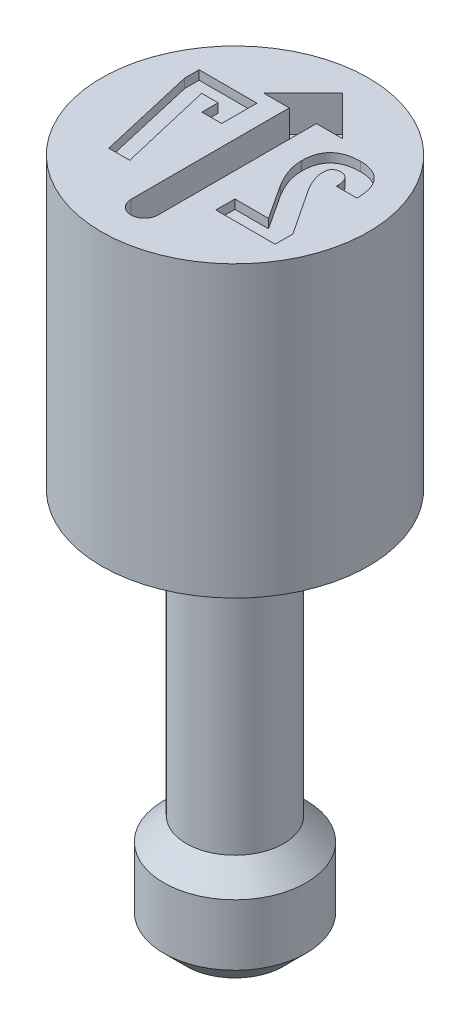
from build123d import *

# Parameters (mm, degrees)
CUT_EXTRUDE1_DEPTH = 0.4064
CUT_EXTRUDE2_DEPTH = 0.1016


with BuildPart() as part:
    # Sketch1 → Revolve1 (revolve)
    with BuildSketch(Plane.XY, mode=Mode.PRIVATE) as revolve1_sk:
        Polygon((0, 7.62), (1.4986, 7.62), (1.4986, 4.3688), (0.5461, 4.3688), (0.5461, 1.1938), (0.8, 0.9399), (0.8, 0.254), (0.546, 0), (0, 0), align=None)
    revolve(revolve1_sk.sketch.rotate(Axis((0, 0, 0), (0, 1, 0)), 90), axis=Axis((0, 0, 0), (0, 1, 0)))

    # Sketch2 → Cut-Extrude1 (cut)
    with BuildSketch(Plane(origin=(0, 7.62, 0), x_dir=(1, 0, 0), z_dir=(0, 1, 0))):
        with BuildLine():
            Line((0.1524, -1.016), (0.1524, 0.762))
            Line((0.1524, 0.762), (0.4445, 0.762))
            Line((0.4445, 0.762), (0, 1.2065))
            Line((0, 1.2065), (-0.4445, 0.762))
            Line((-0.4445, 0.762), (-0.1524, 0.762))
            Line((-0.1524, 0.762), (-0.1524, -1.016))
            ThreePointArc((-0.1524, -1.016), (0, -1.1684), (0.1524, -1.016))
        make_face()
    extrude(amount=-CUT_EXTRUDE1_DEPTH, mode=Mode.SUBTRACT)

    # Sketch3 → Cut-Extrude2 (cut)
    with BuildSketch(Plane(origin=(0, 7.62, 0), x_dir=(1, 0, 0), z_dir=(0, 1, 0))):
        with BuildLine():
            Line((1.093859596, -0.643446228), (1.093859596, -0.443462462))
            Line((1.093859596, -0.443462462), (0.749557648, 0.076340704))
            add(Edge.make_bspline(
                [(0.749557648, 0.076340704), (0.74265923, 0.087960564), (0.729227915, 0.11058459), (0.711563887, 0.144498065), (0.696358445, 0.177087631), (0.68433426, 0.208493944), (0.674730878, 0.238343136), (0.667660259, 0.266456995), (0.663232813, 0.292848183), (0.662704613, 0.309897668), (0.662451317, 0.318073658)],
                knots=[0, 0, 0, 0, 1.248122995, 2.430112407, 3.530856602, 4.568368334, 5.534599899, 6.425730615, 7.245067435, 8, 8, 8, 8], degree=3))
            Line((0.662451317, 0.318073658), (0.662451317, 0.327866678))
            add(Edge.make_bspline(
                [(0.662451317, 0.327866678), (0.662715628, 0.335707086), (0.663214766, 0.350513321), (0.667766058, 0.371312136), (0.675827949, 0.389014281), (0.687164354, 0.403661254), (0.701756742, 0.414940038), (0.719347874, 0.42305122), (0.739934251, 0.427929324), (0.754683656, 0.428389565), (0.7624432, 0.428631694)],
                knots=[0, 0, 0, 0, 1.157982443, 2.186794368, 3.124176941, 4.010641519, 4.897106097, 5.822980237, 6.854687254, 8, 8, 8, 8], degree=3))
            add(Edge.make_bspline(
                [(0.7624432, 0.428631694), (0.770497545, 0.42834535), (0.785892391, 0.427798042), (0.80742957, 0.420548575), (0.826583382, 0.409811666), (0.842197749, 0.393653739), (0.855078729, 0.373641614), (0.864325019, 0.349206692), (0.87114107, 0.320807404), (0.872861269, 0.30033481), (0.873774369, 0.289467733)],
                knots=[0, 0, 0, 0, 0.962338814, 1.839386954, 2.698744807, 3.573548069, 4.505816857, 5.537709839, 6.692989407, 8, 8, 8, 8], degree=3))
            Line((0.873774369, 0.289467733), (0.873774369, 0.264727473))
            Line((0.873774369, 0.264727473), (1.105198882, 0.264727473))
            Line((1.105198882, 0.264727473), (1.105198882, 0.288436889))
            add(Edge.make_bspline(
                [(1.105198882, 0.288436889), (1.104456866, 0.302456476), (1.103013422, 0.329728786), (1.097541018, 0.369271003), (1.089600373, 0.406340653), (1.079123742, 0.440756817), (1.066215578, 0.47270785), (1.05039138, 0.501791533), (1.032372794, 0.528713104), (1.011304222, 0.552640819), (0.988205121, 0.574172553), (0.962595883, 0.592480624), (0.935223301, 0.608494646), (0.90529631, 0.620898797), (0.873550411, 0.631176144), (0.839541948, 0.637835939), (0.803550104, 0.64252227), (0.778781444, 0.642869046), (0.766051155, 0.643047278)],
                knots=[0, 0, 0, 0, 1.213500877, 2.360623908, 3.447485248, 4.488371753, 5.467727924, 6.421569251, 7.346603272, 8.262676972, 9.172071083, 10.070969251, 10.979392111, 11.907908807, 12.866366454, 13.85987356, 14.900044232, 16, 16, 16, 16], degree=3))
            add(Edge.make_bspline(
                [(0.766051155, 0.643047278), (0.752727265, 0.642812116), (0.726879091, 0.642355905), (0.689380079, 0.63849567), (0.654362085, 0.631928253), (0.621577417, 0.623536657), (0.591515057, 0.611633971), (0.563617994, 0.597929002), (0.538586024, 0.580893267), (0.515640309, 0.561854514), (0.49551794, 0.540011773), (0.477823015, 0.515969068), (0.463149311, 0.48939213), (0.450880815, 0.46059832), (0.441757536, 0.429243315), (0.435122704, 0.39561202), (0.430857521, 0.359588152), (0.430459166, 0.334751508), (0.430253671, 0.321939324)],
                knots=[0, 0, 0, 0, 1.204109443, 2.335956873, 3.401973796, 4.42277956, 5.388848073, 6.319444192, 7.226053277, 8.118791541, 9.008824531, 9.903350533, 10.810591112, 11.746516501, 12.726709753, 13.756072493, 14.842451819, 16, 16, 16, 16], degree=3))
            Line((0.430253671, 0.321939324), (0.430253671, 0.312919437))
            add(Edge.make_bspline(
                [(0.430253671, 0.312919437), (0.430591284, 0.299584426), (0.431278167, 0.272454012), (0.437374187, 0.231087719), (0.446839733, 0.188424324), (0.460417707, 0.14456095), (0.477496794, 0.099896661), (0.497658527, 0.054323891), (0.521280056, 0.008259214), (0.539350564, -0.02194498), (0.548543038, -0.037309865)],
                knots=[0, 0, 0, 0, 0.854998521, 1.739515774, 2.676706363, 3.656336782, 4.681823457, 5.742648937, 6.851684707, 8, 8, 8, 8], degree=3))
            Line((0.548543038, -0.037309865), (0.805223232, -0.429030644))
            Line((0.805223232, -0.429030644), (0.42767656, -0.429030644))
            Line((0.42767656, -0.429030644), (0.42767656, -0.643446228))
            Line((0.42767656, -0.643446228), (1.093859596, -0.643446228))
        make_face()
        Polygon((-1.03004016, 0.626553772), (-1.03004016, 0.465226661), (-0.77439081, -0.643446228), (-0.53884292, -0.643446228), (-0.786503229, 0.412138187), (-0.602239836, 0.412138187), (-0.602239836, 0.230709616), (-0.380350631, 0.230709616), (-0.380350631, 0.626553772), align=None)
    extrude(amount=-CUT_EXTRUDE2_DEPTH, mode=Mode.SUBTRACT)


solid = part.part
